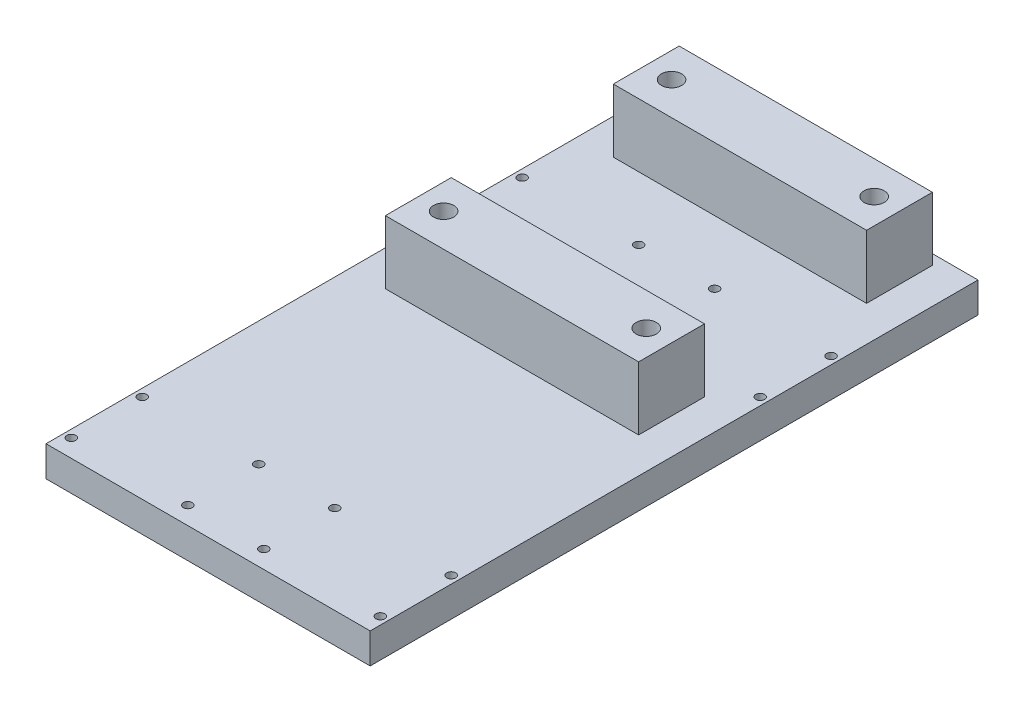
from build123d import *

# Parameters (mm, degrees)
SKETCH1_W           = 203.2
SKETCH1_H           = 381
BASE_EXTRUDE_DEPTH  = 19.05
SKETCH2_W           = 158.75
SKETCH2_H           = 41.275
BOSS_EXTRUDE1_DEPTH = 39.6875
SKETCH4_R           = 6.35
CUT_EXTRUDE1_DEPTH  = 38.1
LPATTERN1_COUNT     = 2
LPATTERN1_PITCH     = 142.875
SKETCH5_R           = 2.778125
CUT_EXTRUDE2_DEPTH  = 399.664839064


with BuildPart() as part:
    # Sketch1 → Base-Extrude (new body)
    with BuildSketch(Plane(origin=(0, 0, 0), x_dir=(1, 0, 0), z_dir=(0, 1, 0))):
        with Locations((0, -190.5)):
            Rectangle(SKETCH1_W, SKETCH1_H)
    extrude(amount=BASE_EXTRUDE_DEPTH)

    # Sketch2 → Boss-Extrude1 (add)
    with BuildSketch(Plane(origin=(0, 19.05, 0), x_dir=(-1, 0, 0), z_dir=(0, 1, 0))):
        with Locations((0, 26.9875)):
            Rectangle(SKETCH2_W, SKETCH2_H)
    boss_extrude1 = extrude(amount=BOSS_EXTRUDE1_DEPTH)

    # Sketch4 → Cut-Extrude1 (cut)
    with BuildSketch(Plane(origin=(0, 58.7375, 0), x_dir=(-1, 0, 0), z_dir=(0, 1, 0))):
        with Locations(Location((-63.5, 26.9875, 0), (0, 0, 90))):
            Circle(SKETCH4_R)
        with Locations(Location((63.5, 26.9875, 0), (0, 0, 90))):
            Circle(SKETCH4_R)
    cut_extrude1 = extrude(amount=-CUT_EXTRUDE1_DEPTH, mode=Mode.SUBTRACT)

    # LPattern1: Boss-Extrude1, Cut-Extrude1 ×2
    with Locations(*[(0, 0, i * LPATTERN1_PITCH) for i in range(1, LPATTERN1_COUNT)]):
        add(boss_extrude1)
        add(cut_extrude1, mode=Mode.SUBTRACT)

    # Sketch5 → Cut-Extrude2 (cut, through all)
    with BuildSketch(Plane.XZ):
        with Locations(Location((96.8375, 87.3125, 0), (0, 0, 270))):
            Circle(SKETCH5_R)
        with Locations(Location((96.8375, 131.7625, 0), (0, 0, 270))):
            Circle(SKETCH5_R)
        with Locations(Location((96.8375, 369.8875, 0), (0, 0, 270))):
            Circle(SKETCH5_R)
        with Locations(Location((96.8375, 325.4375, 0), (0, 0, 270))):
            Circle(SKETCH5_R)
        with Locations(Location((23.8125, 87.3125, 0), (0, 0, 270))):
            Circle(SKETCH5_R)
        with Locations(Location((23.8125, 131.7625, 0), (0, 0, 270))):
            Circle(SKETCH5_R)
        with Locations(Location((-96.8375, 325.4375, 0), (0, 0, 270))):
            Circle(SKETCH5_R)
        with Locations(Location((-96.8375, 369.8875, 0), (0, 0, 270))):
            Circle(SKETCH5_R)
        with Locations(Location((-23.8125, 369.8875, 0), (0, 0, 270))):
            Circle(SKETCH5_R)
        with Locations(Location((-23.8125, 325.4375, 0), (0, 0, 270))):
            Circle(SKETCH5_R)
        with Locations(Location((-96.8375, 87.3125, 0), (0, 0, 270))):
            Circle(SKETCH5_R)
        with Locations(Location((-96.8375, 131.7625, 0), (0, 0, 270))):
            Circle(SKETCH5_R)
        with Locations(Location((-23.8125, 131.7625, 0), (0, 0, 270))):
            Circle(SKETCH5_R)
        with Locations(Location((-23.8125, 87.3125, 0), (0, 0, 270))):
            Circle(SKETCH5_R)
        with Locations(Location((23.8125, 369.8875, 0), (0, 0, 270))):
            Circle(SKETCH5_R)
        with Locations(Location((23.8125, 325.4375, 0), (0, 0, 270))):
            Circle(SKETCH5_R)
    extrude(amount=-CUT_EXTRUDE2_DEPTH, mode=Mode.SUBTRACT)


solid = part.part
